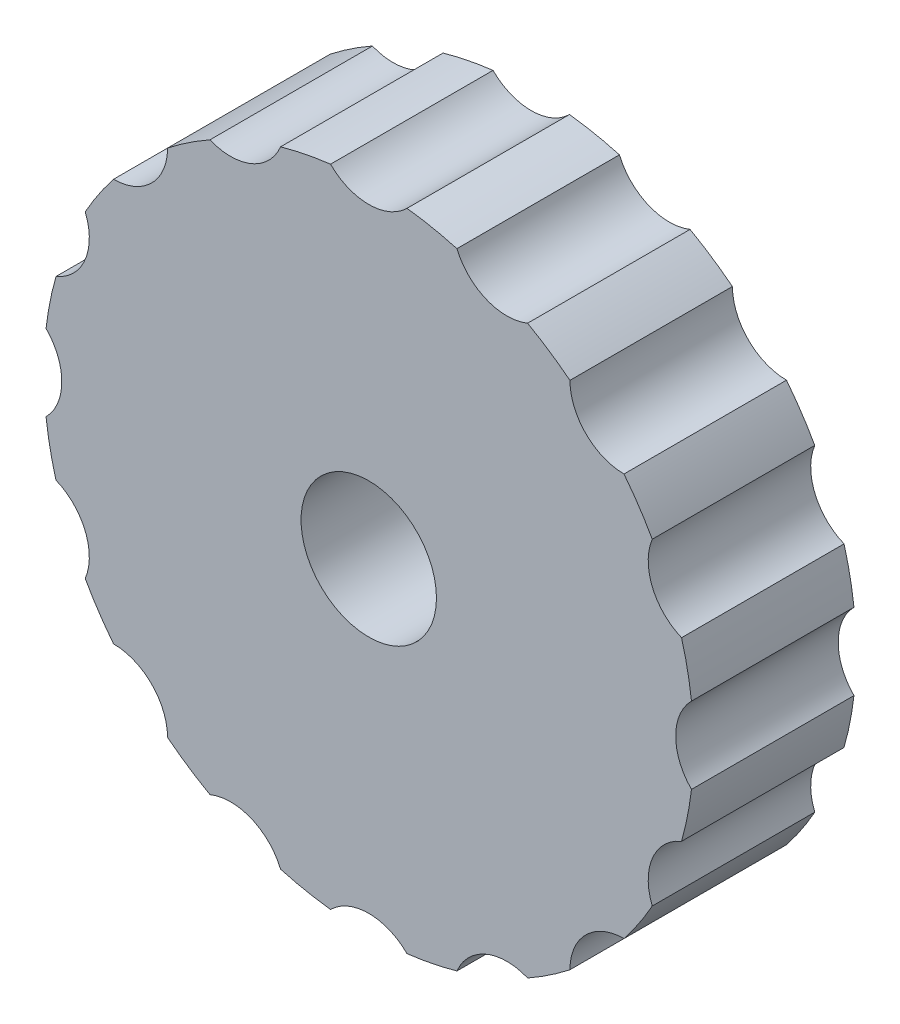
from build123d import *

# Parameters (mm, degrees)
SKETCH1_R           = 18
BOSS_EXTRUDE1_DEPTH = 9
SKETCH2_R           = 3.75
CUT_EXTRUDE1_DEPTH  = 7
CUT_EXTRUDE2_REACH  = 29
SKETCH3_R           = 3
CIRPATTERN1_COUNT   = 16


with BuildPart() as part:
    # Sketch1 → Boss-Extrude1 (new body)
    with BuildSketch(Plane.XY):
        Circle(SKETCH1_R)
    extrude(amount=BOSS_EXTRUDE1_DEPTH)

    # Sketch2 → Cut-Extrude1 (cut)
    with BuildSketch(Plane.XY.offset(9)):
        Circle(SKETCH2_R)
    extrude(amount=-CUT_EXTRUDE1_DEPTH, mode=Mode.SUBTRACT)

    # Sketch3 → Cut-Extrude2 (cut, up to next)
    with BuildSketch(Plane.XY.offset(9), mode=Mode.PRIVATE) as cut_extrude2_sk1:
        with Locations((0, 20)):
            Circle(SKETCH3_R)
    cut_extrude2_tool1 = extrude(cut_extrude2_sk1.sketch, amount=-CUT_EXTRUDE2_REACH, mode=Mode.PRIVATE) & part.part
    cut_extrude2 = cut_extrude2_tool1.solids().sort_by_distance((0, 20, 9))[0]
    add(cut_extrude2, mode=Mode.SUBTRACT)

    # CirPattern1: Cut-Extrude2 ×16 about axis
    cirpattern1_axis = Axis((0, 0, 0), (0, 0, 1))
    for i in range(1, CIRPATTERN1_COUNT):
        add(cut_extrude2.rotate(cirpattern1_axis, i * 360 / CIRPATTERN1_COUNT), mode=Mode.SUBTRACT)


solid = part.part
